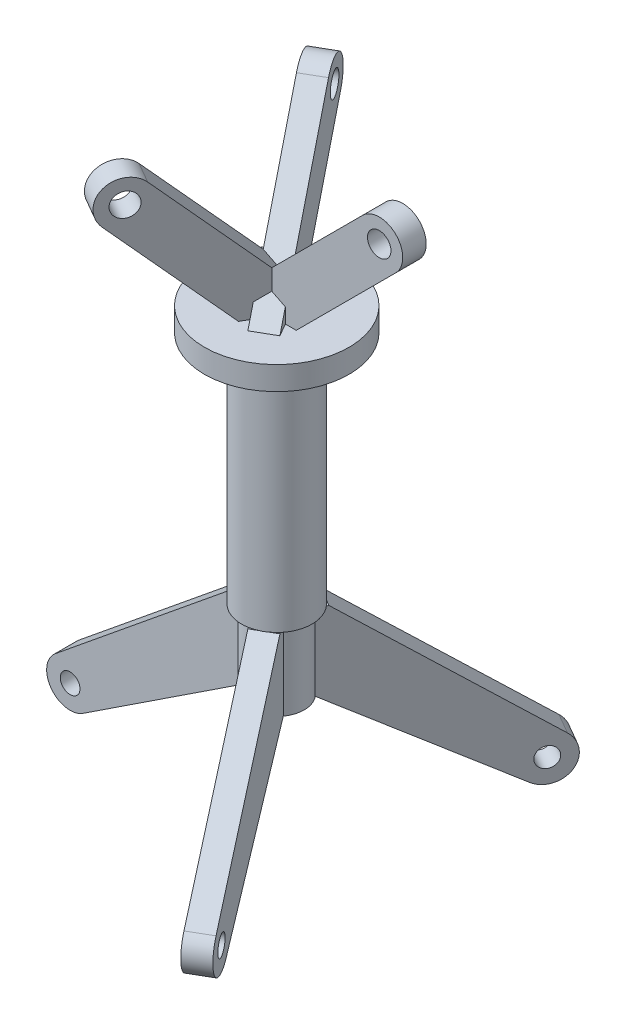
from build123d import *

# Parameters (mm, degrees)
CROQUIS2_R              = 22.5
SALIENTE_EXTRUIR1_DEPTH = 150
CROQUIS3_R              = 17.5
SALIENTE_EXTRUIR2_DEPTH = 50
CROQUIS4_R              = 46.2
SALIENTE_EXTRUIR3_DEPTH = 15
CROQUIS5_R              = 6.3
SALIENTE_EXTRUIR8_DEPTH = 7.5
MATRIZC1_COUNT          = 3
CROQUIS6_R              = 7.5
SALIENTE_EXTRUIR9_DEPTH = 7.5
MATRIZC2_COUNT          = 3


with BuildPart() as part:
    # Croquis2 → Saliente-Extruir1 (new body)
    with BuildSketch(Plane(origin=(0, 0, 0), x_dir=(1, 0, 0), z_dir=(0, 1, 0))):
        with Locations(Location((0, 0, 0), (0, 0, 270))):
            Circle(CROQUIS2_R)
    extrude(amount=SALIENTE_EXTRUIR1_DEPTH)

    # Croquis3 → Saliente-Extruir2 (add)
    with BuildSketch(Plane.XZ):
        with Locations(Location((0, 0, 0), (0, 0, 270))):
            Circle(CROQUIS3_R)
    extrude(amount=SALIENTE_EXTRUIR2_DEPTH)

    # Croquis4 → Saliente-Extruir3 (add)
    with BuildSketch(Plane(origin=(0, 150, 0), x_dir=(1, 0, 0), z_dir=(0, 1, 0))):
        with Locations(Location((0, 0, 0), (0, 0, 270))):
            Circle(CROQUIS4_R)
    extrude(amount=SALIENTE_EXTRUIR3_DEPTH)

    # Croquis5 → Saliente-Extruir8 (add, symmetric)
    with BuildSketch(Plane.XY):
        with BuildLine():
            Line((-22.5, 0), (-133.97575009, -90.842554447))
            ThreePointArc((-133.97575009, -90.842554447), (-136.594337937, -111.343367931), (-116.25301552, -115))
            Line((-116.25301552, -115), (-17.5, -50))
            Line((-17.5, -50), (-13.106310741, -47.108039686))
            Line((-13.106310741, -47.108039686), (-13.106310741, 0))
            Line((-13.106310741, 0), (-13.106310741, 0.062879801))
            Line((-13.106310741, 0.062879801), (-22.422838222, 0.062879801))
            Line((-22.422838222, 0.062879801), (-22.5, 0))
        make_face()
        with Locations((-124.5, -102.470544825)):
            Circle(CROQUIS5_R, mode=Mode.SUBTRACT)
    saliente_extruir8 = extrude(amount=SALIENTE_EXTRUIR8_DEPTH, both=True)

    # MatrizC1: Saliente-Extruir8 ×3 about axis
    matrizc1_axis = Axis((0, 0, 0), (0, 1, 0))
    for i in range(1, MATRIZC1_COUNT):
        add(saliente_extruir8.rotate(matrizc1_axis, i * 360 / MATRIZC1_COUNT))

    # Croquis6 → Saliente-Extruir9 (add, symmetric)
    with BuildSketch(Plane.XY):
        with BuildLine():
            Line((-22.5, 164.996441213), (62.352813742, 249.849254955))
            ThreePointArc((62.352813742, 249.849254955), (83.566017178, 249.849254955), (83.566017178, 228.636051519))
            Line((83.566017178, 228.636051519), (19.929965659, 165))
            Line((19.929965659, 165), (-22.5, 164.996441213))
        make_face()
        with Locations((72.95941546, 239.242653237)):
            Circle(CROQUIS6_R, mode=Mode.SUBTRACT)
    saliente_extruir9 = extrude(amount=SALIENTE_EXTRUIR9_DEPTH, both=True)

    # MatrizC2: Saliente-Extruir9 ×3 about axis
    matrizc2_axis = Axis((0, 0, 0), (0, 1, 0))
    for i in range(1, MATRIZC2_COUNT):
        add(saliente_extruir9.rotate(matrizc2_axis, i * 360 / MATRIZC2_COUNT))


solid = part.part
